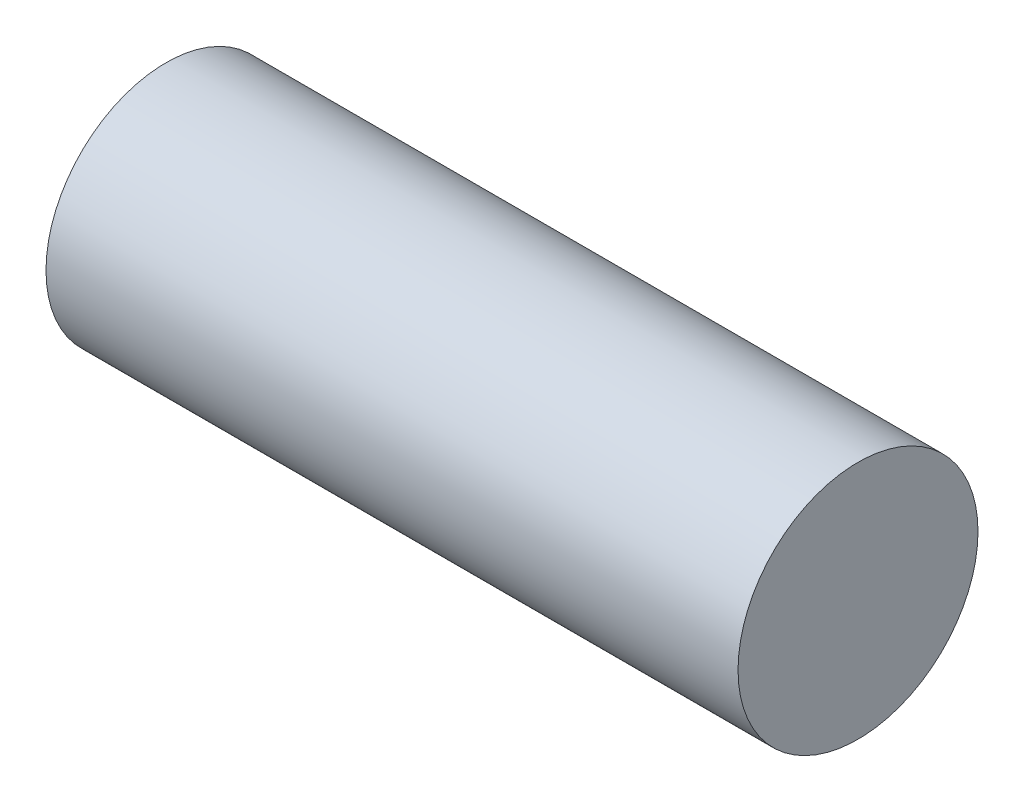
from build123d import *

# Parameters (mm, degrees)
SKIZZE1_W = 9.805705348
SKIZZE1_H = 1.7


with BuildPart() as part:
    # Skizze1 → Rotation1 (revolve)
    with BuildSketch(Plane.XY, mode=Mode.PRIVATE) as rotation1_sk:
        with Locations((58.447147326, 0.85)):
            Rectangle(SKIZZE1_W, SKIZZE1_H)
    revolve(rotation1_sk.sketch.rotate(Axis((53.544294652, 0, 0), (1, 0, 0)), 90), axis=Axis((53.544294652, 0, 0), (1, 0, 0)))


solid = part.part
